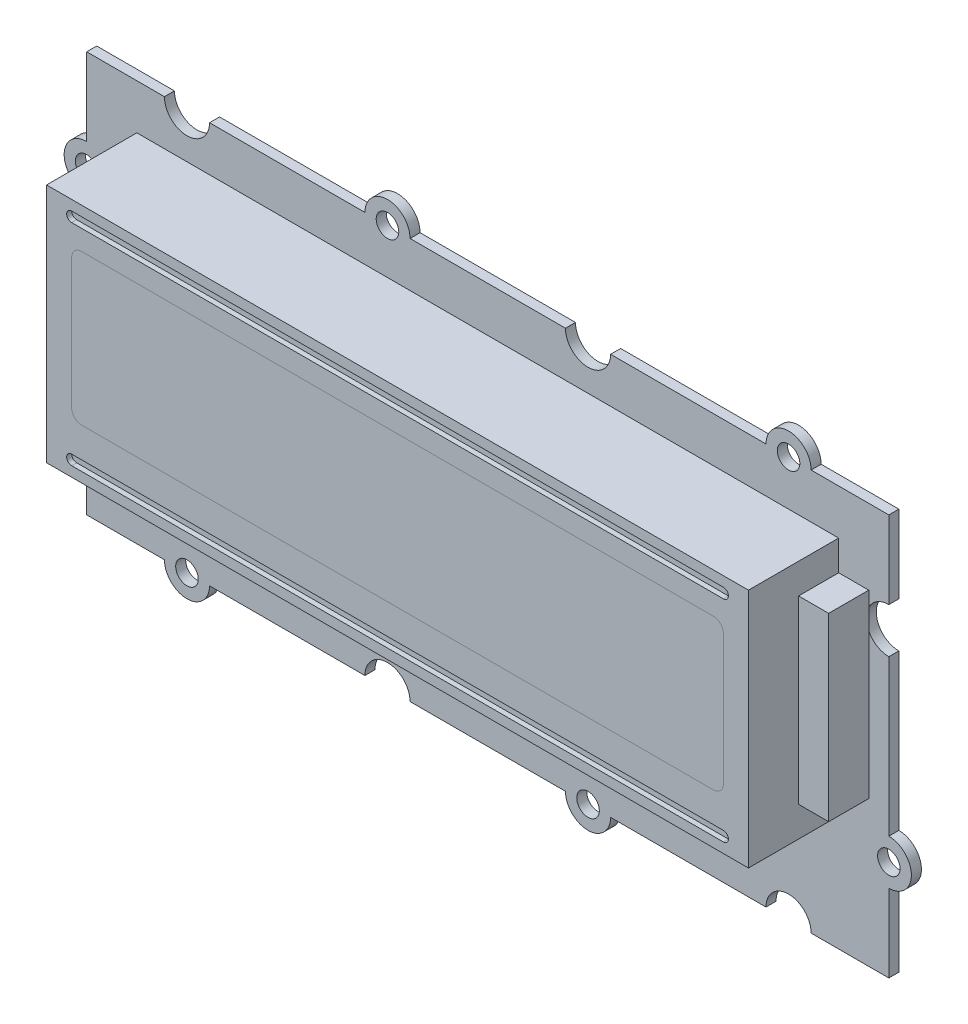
from build123d import *

# Parameters (mm, degrees)
ESQUISSE1_R             = 1.125
BOSS_EXTRU_1_DEPTH      = 1
ESQUISSE2_W             = 70
ESQUISSE2_H             = 24
BOSS_EXTRU_2_DEPTH      = 9
ENL_V_MAT_EXTRU_1_DEPTH = 0.5
BOSS_EXTRU_4_DEPTH      = 1
ESQUISSE5_W             = 4
ESQUISSE5_H             = 18
BOSS_EXTRU_5_DEPTH      = 3


with BuildPart() as part:
    # Esquisse1 → Boss.-Extru.1 (new body)
    with BuildSketch(Plane.XY):
        with BuildLine():
            Line((-40, 20), (-32.25, 20))
            ThreePointArc((-32.25, 20), (-30, 17.75), (-27.75, 20))
            Line((-27.75, 20), (-12.25, 20))
            ThreePointArc((-12.25, 20), (-10, 22.25), (-7.75, 20))
            Line((-7.75, 20), (7.75, 20))
            ThreePointArc((7.75, 20), (10, 17.75), (12.25, 20))
            Line((12.25, 20), (27.75, 20))
            ThreePointArc((27.75, 20), (30, 22.25), (32.25, 20))
            Line((32.25, 20), (40, 20))
            Line((40, 20), (40, 12.25))
            ThreePointArc((40, 12.25), (37.75, 10), (40, 7.75))
            Line((40, 7.75), (40, -7.75))
            ThreePointArc((40, -7.75), (42.25, -10), (40, -12.25))
            Line((40, -12.25), (40, -20))
            Line((40, -20), (32.25, -20))
            ThreePointArc((32.25, -20), (30, -17.75), (27.75, -20))
            Line((27.75, -20), (12.25, -20))
            ThreePointArc((12.25, -20), (10, -22.25), (7.75, -20))
            Line((7.75, -20), (-7.75, -20))
            ThreePointArc((-7.75, -20), (-10, -17.75), (-12.25, -20))
            Line((-12.25, -20), (-27.75, -20))
            ThreePointArc((-27.75, -20), (-30, -22.25), (-32.25, -20))
            Line((-32.25, -20), (-40, -20))
            Line((-40, -20), (-40, -12.25))
            ThreePointArc((-40, -12.25), (-37.75, -10), (-40, -7.75))
            Line((-40, -7.75), (-40, 7.75))
            ThreePointArc((-40, 7.75), (-42.25, 10), (-40, 12.25))
            Line((-40, 12.25), (-40, 20))
        make_face()
        with Locations((-10, 20)):
            Circle(ESQUISSE1_R, mode=Mode.SUBTRACT)
        with Locations((30, 20)):
            Circle(ESQUISSE1_R, mode=Mode.SUBTRACT)
        with Locations((-40, 10)):
            Circle(ESQUISSE1_R, mode=Mode.SUBTRACT)
        with Locations(Location((40, -10, 0), (0, 0, 180))):
            Circle(ESQUISSE1_R, mode=Mode.SUBTRACT)
        with Locations(Location((10, -20, 0), (0, 0, 180))):
            Circle(ESQUISSE1_R, mode=Mode.SUBTRACT)
        with Locations(Location((-30, -20, 0), (0, 0, 180))):
            Circle(ESQUISSE1_R, mode=Mode.SUBTRACT)
    extrude(amount=BOSS_EXTRU_1_DEPTH)

    # Esquisse2 → Boss.-Extru.2 (add)
    with BuildSketch(Plane.XY.offset(1)):
        with Locations((0, 3.5)):
            Rectangle(ESQUISSE2_W, ESQUISSE2_H)
        with BuildLine():
            Line((-31.5, 11.5), (31.5, 11.5))
            ThreePointArc((31.5, 11.5), (32.207106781, 11.207106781), (32.5, 10.5))
            Line((32.5, 10.5), (32.5, -2.5))
            ThreePointArc((32.5, -2.5), (32.207106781, -3.207106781), (31.5, -3.5))
            Line((31.5, -3.5), (-31.5, -3.5))
            ThreePointArc((-31.5, -3.5), (-32.207106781, -3.207106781), (-32.5, -2.5))
            Line((-32.5, -2.5), (-32.5, 10.5))
            ThreePointArc((-32.5, 10.5), (-32.207106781, 11.207106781), (-31.5, 11.5))
        make_face(mode=Mode.SUBTRACT)
    extrude(amount=BOSS_EXTRU_2_DEPTH)

    # Esquisse3 → Enl_v. mat.-Extru.1 (cut)
    with BuildSketch(Plane.XY.offset(10)):
        with BuildLine():
            Line((-32.5, 14.5), (32.5, 14.5))
            ThreePointArc((32.5, 14.5), (33, 14), (32.5, 13.5))
            Line((32.5, 13.5), (-32.5, 13.5))
            ThreePointArc((-32.5, 13.5), (-33, 14), (-32.5, 14.5))
        make_face()
        with BuildLine():
            Line((-32.5, -6.5), (32.5, -6.5))
            ThreePointArc((32.5, -6.5), (33, -7), (32.5, -7.5))
            Line((32.5, -7.5), (-32.5, -7.5))
            ThreePointArc((-32.5, -7.5), (-33, -7), (-32.5, -6.5))
        make_face()
    extrude(amount=-ENL_V_MAT_EXTRU_1_DEPTH, mode=Mode.SUBTRACT)

    # Esquisse5 → Boss.-Extru.5 (add)
    with BuildSketch(Plane(origin=(35, 0, 0), x_dir=(0, 0, -1), z_dir=(1, 0, 0))):
        with Locations((-3, 3.5)):
            Rectangle(ESQUISSE5_W, ESQUISSE5_H)
    extrude(amount=BOSS_EXTRU_5_DEPTH)


with BuildPart() as body_2:
    # Esquisse4 → Boss.-Extru.4 (new body)
    with BuildSketch(Plane.XY.offset(10)):
        with BuildLine():
            Line((32.5, -2.5), (32.5, 10.5))
            ThreePointArc((32.5, 10.5), (32.207106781, 11.207106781), (31.5, 11.5))
            Line((31.5, 11.5), (-31.5, 11.5))
            ThreePointArc((-31.5, 11.5), (-32.207106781, 11.207106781), (-32.5, 10.5))
            Line((-32.5, 10.5), (-32.5, -2.5))
            ThreePointArc((-32.5, -2.5), (-32.207106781, -3.207106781), (-31.5, -3.5))
            Line((-31.5, -3.5), (31.5, -3.5))
            ThreePointArc((31.5, -3.5), (32.207106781, -3.207106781), (32.5, -2.5))
        make_face()
    extrude(amount=-BOSS_EXTRU_4_DEPTH)


solid = Compound([part.part, body_2.part])
